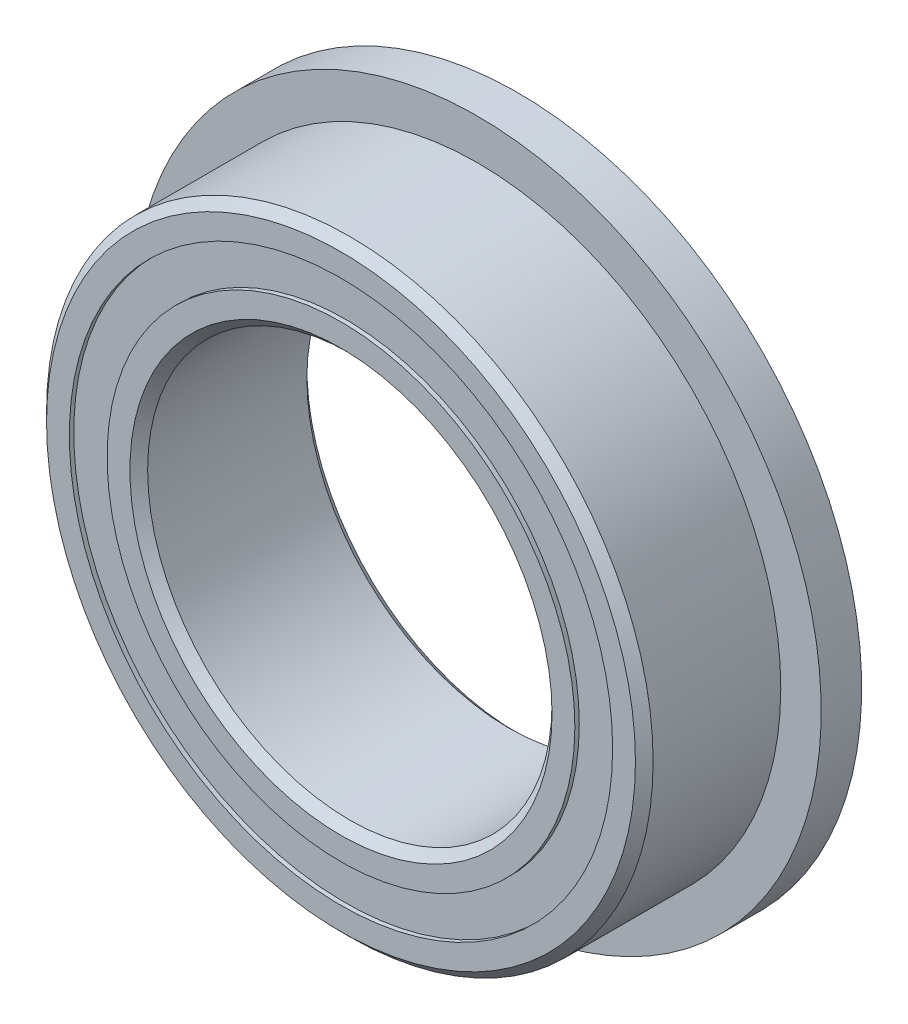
from build123d import *

# Parameters (mm, degrees)
CIRPATTERN1_COUNT = 12
SKETCH5_W         = 0.79963562
SKETCH5_H         = 0.747252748
SKETCH6_W         = 0.8
SKETCH6_H         = 1.426373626


with BuildPart() as part:
    # Sketch1 → Revolve1 (revolve)
    with BuildSketch(Plane(origin=(0, 0, 0), x_dir=(0, 0, -1), z_dir=(1, 0, 0)), mode=Mode.PRIVATE) as revolve1_sk:
        with BuildLine():
            Line((1.575, 6), (-1.575, 6))
            Line((-1.575, 6), (-1.75, 5.825))
            Line((-1.75, 5.825), (-1.75, 5.373626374))
            Line((-1.75, 5.373626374), (-0.777777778, 5.373626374))
            ThreePointArc((-0.777777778, 5.373626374), (0, 5.86286438), (0.777777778, 5.373626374))
            Line((0.777777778, 5.373626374), (1.75, 5.373626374))
            Line((1.75, 5.373626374), (1.75, 5.825))
            Line((1.75, 5.825), (1.575, 6))
        make_face()
    revolve(revolve1_sk.sketch.rotate(Axis((0, 0, 1.75), (0, 0, -1)), 90), axis=Axis((0, 0, 1.75), (0, 0, -1)))

    # Sketch6 → Revolve6 (revolve)
    with BuildSketch(Plane(origin=(0, 0, 0), x_dir=(0, 0, -1), z_dir=(1, 0, 0)), mode=Mode.PRIVATE) as revolve6_sk:
        with Locations((1.35, 6.086813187)):
            Rectangle(SKETCH6_W, SKETCH6_H)
    revolve(revolve6_sk.sketch.rotate(Axis((0, 0, -1.75), (0, 0, 1)), 270), axis=Axis((0, 0, -1.75), (0, 0, 1)))


with BuildPart() as body_2:
    # Sketch3 → Revolve3 (revolve)
    with BuildSketch(Plane(origin=(0, 0, 0), x_dir=(0, 0, -1), z_dir=(1, 0, 0)), mode=Mode.PRIVATE) as revolve3_sk:
        with BuildLine():
            Line((-1.75, 4.626373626), (-0.777777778, 4.626373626))
            ThreePointArc((-0.777777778, 4.626373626), (0, 4.13713562), (0.777777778, 4.626373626))
            Line((0.777777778, 4.626373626), (1.75, 4.626373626))
            Line((1.75, 4.626373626), (1.75, 4.175))
            Line((1.75, 4.175), (1.575, 4))
            Line((1.575, 4), (-1.575, 4))
            Line((-1.575, 4), (-1.75, 4.175))
            Line((-1.75, 4.175), (-1.75, 4.626373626))
        make_face()
    revolve(revolve3_sk.sketch.rotate(Axis((0, 0, 1.75), (0, 0, -1)), 90), axis=Axis((0, 0, 1.75), (0, 0, -1)))


with BuildPart() as body_3:
    # Sketch4 → Revolve4 (revolve)
    with BuildSketch(Plane(origin=(0, 0, 0), x_dir=(0, 0, -1), z_dir=(1, 0, 0))):
        with BuildLine():
            Line((-0.86286438, 5), (0.86286438, 5))
            ThreePointArc((0.86286438, 5), (0, 5.86286438), (-0.86286438, 5))
        make_face()
    revolve(axis=Axis((0, 5, 0.86286438), (0, 0, -1)))


with BuildPart() as cirpattern1_1:
    # CirPattern1: pattern copy
    add(body_3.part.rotate(Axis((0, 0, 0), (0, 0, 1)), 1 * 360 / CIRPATTERN1_COUNT))


with BuildPart() as cirpattern1_2:
    # CirPattern1: pattern copy
    add(body_3.part.rotate(Axis((0, 0, 0), (0, 0, 1)), 2 * 360 / CIRPATTERN1_COUNT))


with BuildPart() as cirpattern1_3:
    # CirPattern1: pattern copy
    add(body_3.part.rotate(Axis((0, 0, 0), (0, 0, 1)), 3 * 360 / CIRPATTERN1_COUNT))


with BuildPart() as cirpattern1_4:
    # CirPattern1: pattern copy
    add(body_3.part.rotate(Axis((0, 0, 0), (0, 0, 1)), 4 * 360 / CIRPATTERN1_COUNT))


with BuildPart() as cirpattern1_5:
    # CirPattern1: pattern copy
    add(body_3.part.rotate(Axis((0, 0, 0), (0, 0, 1)), 5 * 360 / CIRPATTERN1_COUNT))


with BuildPart() as cirpattern1_6:
    # CirPattern1: pattern copy
    add(body_3.part.rotate(Axis((0, 0, 0), (0, 0, 1)), 6 * 360 / CIRPATTERN1_COUNT))


with BuildPart() as cirpattern1_7:
    # CirPattern1: pattern copy
    add(body_3.part.rotate(Axis((0, 0, 0), (0, 0, 1)), 7 * 360 / CIRPATTERN1_COUNT))


with BuildPart() as cirpattern1_8:
    # CirPattern1: pattern copy
    add(body_3.part.rotate(Axis((0, 0, 0), (0, 0, 1)), 8 * 360 / CIRPATTERN1_COUNT))


with BuildPart() as cirpattern1_9:
    # CirPattern1: pattern copy
    add(body_3.part.rotate(Axis((0, 0, 0), (0, 0, 1)), 9 * 360 / CIRPATTERN1_COUNT))


with BuildPart() as cirpattern1_10:
    # CirPattern1: pattern copy
    add(body_3.part.rotate(Axis((0, 0, 0), (0, 0, 1)), 10 * 360 / CIRPATTERN1_COUNT))


with BuildPart() as cirpattern1_11:
    # CirPattern1: pattern copy
    add(body_3.part.rotate(Axis((0, 0, 0), (0, 0, 1)), 11 * 360 / CIRPATTERN1_COUNT))


with BuildPart() as body_15:
    # Sketch5 → Revolve5 (revolve)
    with BuildSketch(Plane(origin=(0, 0, 0), x_dir=(0, 0, -1), z_dir=(1, 0, 0)), mode=Mode.PRIVATE) as revolve5_sk:
        with Locations((-1.26268219, 5)):
            Rectangle(SKETCH5_W, SKETCH5_H)
        with Locations((1.26268219, 5)):
            Rectangle(SKETCH5_W, SKETCH5_H)
    revolve(revolve5_sk.sketch.rotate(Axis((0, 0, 1.75), (0, 0, -1)), 90), axis=Axis((0, 0, 1.75), (0, 0, -1)))


solid = Compound([part.part, body_2.part, body_3.part, cirpattern1_1.part, cirpattern1_2.part, cirpattern1_3.part, cirpattern1_4.part, cirpattern1_5.part, cirpattern1_6.part, cirpattern1_7.part, cirpattern1_8.part, cirpattern1_9.part, cirpattern1_10.part, cirpattern1_11.part, body_15.part])
